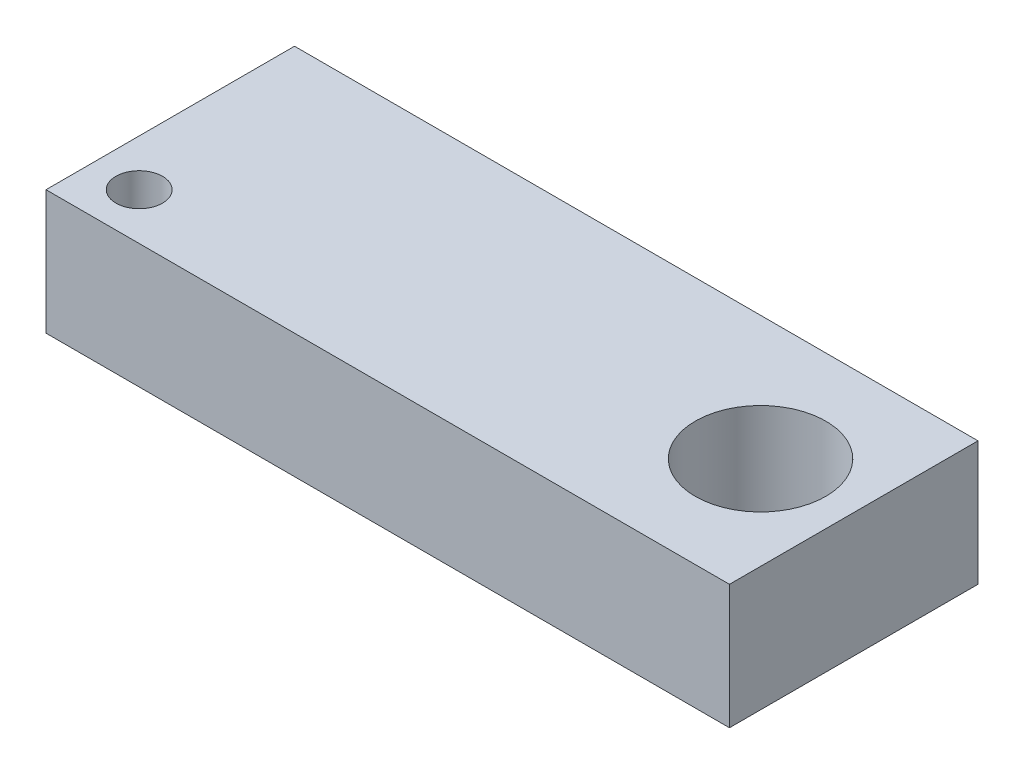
ISO-10303-21;
HEADER;
FILE_DESCRIPTION(('STEP AP214'),'2;1');
FILE_NAME('part.step','',(''),(''),'','','');
FILE_SCHEMA(('AUTOMOTIVE_DESIGN { 1 0 10303 214 1 1 1 1 }'));
ENDSEC;
DATA;
#1=APPLICATION_CONTEXT('core data for automotive mechanical design processes');
#2=APPLICATION_PROTOCOL_DEFINITION('international standard','automotive_design',2000,#1);
#3=PRODUCT_CONTEXT('',#1,'mechanical');
#4=PRODUCT('Part','Part','',(#3));
#5=PRODUCT_RELATED_PRODUCT_CATEGORY('part','',(#4));
#6=PRODUCT_DEFINITION_FORMATION('','',#4);
#7=PRODUCT_DEFINITION_CONTEXT('part definition',#1,'design');
#8=PRODUCT_DEFINITION('design','',#6,#7);
#9=PRODUCT_DEFINITION_SHAPE('','',#8);
#10=(LENGTH_UNIT() NAMED_UNIT(*) SI_UNIT(.MILLI.,.METRE.));
#11=(NAMED_UNIT(*) PLANE_ANGLE_UNIT() SI_UNIT($,.RADIAN.));
#12=(NAMED_UNIT(*) SI_UNIT($,.STERADIAN.) SOLID_ANGLE_UNIT());
#13=UNCERTAINTY_MEASURE_WITH_UNIT(LENGTH_MEASURE(1.E-05),#10,'distance_accuracy_value','');
#14=(GEOMETRIC_REPRESENTATION_CONTEXT(3) GLOBAL_UNCERTAINTY_ASSIGNED_CONTEXT((#13)) GLOBAL_UNIT_ASSIGNED_CONTEXT((#10,
#11,#12)) REPRESENTATION_CONTEXT('',''));
#15=CARTESIAN_POINT('',(0.,0.,0.));
#16=DIRECTION('',(0.,0.,1.));
#17=DIRECTION('',(1.,0.,0.));
#18=AXIS2_PLACEMENT_3D('',#15,#16,#17);
#19=CARTESIAN_POINT('',(0.,0.,80.));
#20=DIRECTION('',(1.,0.,0.));
#21=DIRECTION('',(0.,0.,-1.));
#22=AXIS2_PLACEMENT_3D('',#19,#20,#21);
#23=PLANE('',#22);
#24=DIRECTION('',(0.,-1.,0.));
#25=VECTOR('',#24,1.);
#26=CARTESIAN_POINT('',(0.,0.,0.));
#27=LINE('',#26,#25);
#28=CARTESIAN_POINT('',(0.,40.,0.));
#29=VERTEX_POINT('',#28);
#30=CARTESIAN_POINT('',(0.,0.,0.));
#31=VERTEX_POINT('',#30);
#32=EDGE_CURVE('E68',#29,#31,#27,.T.);
#33=ORIENTED_EDGE('',*,*,#32,.T.);
#34=DIRECTION('',(0.,0.,-1.));
#35=VECTOR('',#34,1.);
#36=CARTESIAN_POINT('',(0.,0.,80.));
#37=LINE('',#36,#35);
#38=CARTESIAN_POINT('',(0.,0.,80.));
#39=VERTEX_POINT('',#38);
#40=EDGE_CURVE('E11',#39,#31,#37,.T.);
#41=ORIENTED_EDGE('',*,*,#40,.F.);
#42=DIRECTION('',(0.,-1.,0.));
#43=VECTOR('',#42,1.);
#44=CARTESIAN_POINT('',(0.,0.,80.));
#45=LINE('',#44,#43);
#46=CARTESIAN_POINT('',(0.,40.,80.));
#47=VERTEX_POINT('',#46);
#48=EDGE_CURVE('E91',#47,#39,#45,.T.);
#49=ORIENTED_EDGE('',*,*,#48,.F.);
#50=DIRECTION('',(0.,0.,-1.));
#51=VECTOR('',#50,1.);
#52=CARTESIAN_POINT('',(0.,40.,80.));
#53=LINE('',#52,#51);
#54=EDGE_CURVE('E80',#47,#29,#53,.T.);
#55=ORIENTED_EDGE('',*,*,#54,.T.);
#56=EDGE_LOOP('',(#33,#41,#49,#55));
#57=FACE_BOUND('',#56,.T.);
#58=ADVANCED_FACE('F24',(#57),#23,.F.);
#59=CARTESIAN_POINT('',(0.,0.,80.));
#60=DIRECTION('',(0.,1.,0.));
#61=DIRECTION('',(0.,0.,1.));
#62=AXIS2_PLACEMENT_3D('',#59,#60,#61);
#63=PLANE('',#62);
#64=CARTESIAN_POINT('',(15.,0.,65.));
#65=DIRECTION('',(0.,1.,0.));
#66=DIRECTION('',(0.,0.,1.));
#67=AXIS2_PLACEMENT_3D('',#64,#65,#66);
#68=CIRCLE('',#67,7.5);
#69=CARTESIAN_POINT('',(15.,0.,72.5));
#70=VERTEX_POINT('',#69);
#71=EDGE_CURVE('E126',#70,#70,#68,.T.);
#72=ORIENTED_EDGE('',*,*,#71,.T.);
#73=EDGE_LOOP('',(#72));
#74=FACE_BOUND('',#73,.T.);
#75=CARTESIAN_POINT('',(190.,0.,40.));
#76=DIRECTION('',(0.,1.,0.));
#77=DIRECTION('',(0.,0.,1.));
#78=AXIS2_PLACEMENT_3D('',#75,#76,#77);
#79=CIRCLE('',#78,21.);
#80=CARTESIAN_POINT('',(190.,0.,61.));
#81=VERTEX_POINT('',#80);
#82=EDGE_CURVE('E81',#81,#81,#79,.T.);
#83=ORIENTED_EDGE('',*,*,#82,.T.);
#84=EDGE_LOOP('',(#83));
#85=FACE_BOUND('',#84,.T.);
#86=DIRECTION('',(1.,0.,0.));
#87=VECTOR('',#86,1.);
#88=CARTESIAN_POINT('',(0.,0.,0.));
#89=LINE('',#88,#87);
#90=CARTESIAN_POINT('',(220.,0.,0.));
#91=VERTEX_POINT('',#90);
#92=EDGE_CURVE('E64',#31,#91,#89,.T.);
#93=ORIENTED_EDGE('',*,*,#92,.T.);
#94=DIRECTION('',(0.,0.,-1.));
#95=VECTOR('',#94,1.);
#96=CARTESIAN_POINT('',(220.,0.,80.));
#97=LINE('',#96,#95);
#98=CARTESIAN_POINT('',(220.,0.,80.));
#99=VERTEX_POINT('',#98);
#100=EDGE_CURVE('E31',#99,#91,#97,.T.);
#101=ORIENTED_EDGE('',*,*,#100,.F.);
#102=DIRECTION('',(1.,0.,0.));
#103=VECTOR('',#102,1.);
#104=CARTESIAN_POINT('',(0.,0.,80.));
#105=LINE('',#104,#103);
#106=EDGE_CURVE('E76',#39,#99,#105,.T.);
#107=ORIENTED_EDGE('',*,*,#106,.F.);
#108=ORIENTED_EDGE('',*,*,#40,.T.);
#109=EDGE_LOOP('',(#93,#101,#107,#108));
#110=FACE_BOUND('',#109,.T.);
#111=ADVANCED_FACE('F75',(#74,#85,#110),#63,.F.);
#112=CARTESIAN_POINT('',(220.,0.,80.));
#113=DIRECTION('',(-1.,0.,0.));
#114=DIRECTION('',(0.,0.,1.));
#115=AXIS2_PLACEMENT_3D('',#112,#113,#114);
#116=PLANE('',#115);
#117=DIRECTION('',(0.,1.,0.));
#118=VECTOR('',#117,1.);
#119=CARTESIAN_POINT('',(220.,0.,0.));
#120=LINE('',#119,#118);
#121=CARTESIAN_POINT('',(220.,40.,0.));
#122=VERTEX_POINT('',#121);
#123=EDGE_CURVE('E69',#91,#122,#120,.T.);
#124=ORIENTED_EDGE('',*,*,#123,.T.);
#125=DIRECTION('',(0.,0.,-1.));
#126=VECTOR('',#125,1.);
#127=CARTESIAN_POINT('',(220.,40.,80.));
#128=LINE('',#127,#126);
#129=CARTESIAN_POINT('',(220.,40.,80.));
#130=VERTEX_POINT('',#129);
#131=EDGE_CURVE('E97',#130,#122,#128,.T.);
#132=ORIENTED_EDGE('',*,*,#131,.F.);
#133=DIRECTION('',(0.,1.,0.));
#134=VECTOR('',#133,1.);
#135=CARTESIAN_POINT('',(220.,0.,80.));
#136=LINE('',#135,#134);
#137=EDGE_CURVE('E43',#99,#130,#136,.T.);
#138=ORIENTED_EDGE('',*,*,#137,.F.);
#139=ORIENTED_EDGE('',*,*,#100,.T.);
#140=EDGE_LOOP('',(#124,#132,#138,#139));
#141=FACE_BOUND('',#140,.T.);
#142=ADVANCED_FACE('F100',(#141),#116,.F.);
#143=CARTESIAN_POINT('',(0.,40.,80.));
#144=DIRECTION('',(0.,-1.,0.));
#145=DIRECTION('',(0.,0.,-1.));
#146=AXIS2_PLACEMENT_3D('',#143,#144,#145);
#147=PLANE('',#146);
#148=CARTESIAN_POINT('',(15.,40.,65.));
#149=DIRECTION('',(0.,1.,0.));
#150=DIRECTION('',(0.,0.,1.));
#151=AXIS2_PLACEMENT_3D('',#148,#149,#150);
#152=CIRCLE('',#151,7.5);
#153=CARTESIAN_POINT('',(15.,40.,72.5));
#154=VERTEX_POINT('',#153);
#155=EDGE_CURVE('E136',#154,#154,#152,.T.);
#156=ORIENTED_EDGE('',*,*,#155,.F.);
#157=EDGE_LOOP('',(#156));
#158=FACE_BOUND('',#157,.T.);
#159=CARTESIAN_POINT('',(190.,40.,40.));
#160=DIRECTION('',(0.,1.,0.));
#161=DIRECTION('',(0.,0.,1.));
#162=AXIS2_PLACEMENT_3D('',#159,#160,#161);
#163=CIRCLE('',#162,21.);
#164=CARTESIAN_POINT('',(190.,40.,61.));
#165=VERTEX_POINT('',#164);
#166=EDGE_CURVE('E84',#165,#165,#163,.T.);
#167=ORIENTED_EDGE('',*,*,#166,.F.);
#168=EDGE_LOOP('',(#167));
#169=FACE_BOUND('',#168,.T.);
#170=DIRECTION('',(-1.,0.,0.));
#171=VECTOR('',#170,1.);
#172=CARTESIAN_POINT('',(0.,40.,0.));
#173=LINE('',#172,#171);
#174=EDGE_CURVE('E89',#122,#29,#173,.T.);
#175=ORIENTED_EDGE('',*,*,#174,.T.);
#176=ORIENTED_EDGE('',*,*,#54,.F.);
#177=DIRECTION('',(-1.,0.,0.));
#178=VECTOR('',#177,1.);
#179=CARTESIAN_POINT('',(0.,40.,80.));
#180=LINE('',#179,#178);
#181=EDGE_CURVE('E38',#130,#47,#180,.T.);
#182=ORIENTED_EDGE('',*,*,#181,.F.);
#183=ORIENTED_EDGE('',*,*,#131,.T.);
#184=EDGE_LOOP('',(#175,#176,#182,#183));
#185=FACE_BOUND('',#184,.T.);
#186=ADVANCED_FACE('F102',(#158,#169,#185),#147,.F.);
#187=CARTESIAN_POINT('',(0.,40.,80.));
#188=DIRECTION('',(0.,0.,-1.));
#189=DIRECTION('',(-1.,0.,0.));
#190=AXIS2_PLACEMENT_3D('',#187,#188,#189);
#191=PLANE('',#190);
#192=ORIENTED_EDGE('',*,*,#48,.T.);
#193=ORIENTED_EDGE('',*,*,#106,.T.);
#194=ORIENTED_EDGE('',*,*,#137,.T.);
#195=ORIENTED_EDGE('',*,*,#181,.T.);
#196=EDGE_LOOP('',(#192,#193,#194,#195));
#197=FACE_BOUND('',#196,.T.);
#198=ADVANCED_FACE('F103',(#197),#191,.F.);
#199=CARTESIAN_POINT('',(0.,40.,0.));
#200=DIRECTION('',(0.,0.,-1.));
#201=DIRECTION('',(-1.,0.,0.));
#202=AXIS2_PLACEMENT_3D('',#199,#200,#201);
#203=PLANE('',#202);
#204=ORIENTED_EDGE('',*,*,#32,.F.);
#205=ORIENTED_EDGE('',*,*,#174,.F.);
#206=ORIENTED_EDGE('',*,*,#123,.F.);
#207=ORIENTED_EDGE('',*,*,#92,.F.);
#208=EDGE_LOOP('',(#204,#205,#206,#207));
#209=FACE_BOUND('',#208,.T.);
#210=ADVANCED_FACE('F65',(#209),#203,.T.);
#211=CARTESIAN_POINT('',(190.,0.,40.));
#212=DIRECTION('',(0.,1.,0.));
#213=DIRECTION('',(0.,0.,1.));
#214=AXIS2_PLACEMENT_3D('',#211,#212,#213);
#215=CYLINDRICAL_SURFACE('',#214,21.);
#216=ORIENTED_EDGE('',*,*,#82,.F.);
#217=EDGE_LOOP('',(#216));
#218=FACE_BOUND('',#217,.T.);
#219=ORIENTED_EDGE('',*,*,#166,.T.);
#220=EDGE_LOOP('',(#219));
#221=FACE_BOUND('',#220,.T.);
#222=ADVANCED_FACE('F110',(#218,#221),#215,.F.);
#223=CARTESIAN_POINT('',(15.,0.,65.));
#224=DIRECTION('',(0.,1.,0.));
#225=DIRECTION('',(0.,0.,1.));
#226=AXIS2_PLACEMENT_3D('',#223,#224,#225);
#227=CYLINDRICAL_SURFACE('',#226,7.5);
#228=ORIENTED_EDGE('',*,*,#71,.F.);
#229=EDGE_LOOP('',(#228));
#230=FACE_BOUND('',#229,.T.);
#231=ORIENTED_EDGE('',*,*,#155,.T.);
#232=EDGE_LOOP('',(#231));
#233=FACE_BOUND('',#232,.T.);
#234=ADVANCED_FACE('F131',(#230,#233),#227,.F.);
#235=CLOSED_SHELL('',(#58,#111,#142,#186,#198,#210,#222,#234));
#236=MANIFOLD_SOLID_BREP('B2',#235);
#237=ADVANCED_BREP_SHAPE_REPRESENTATION('',(#18,#236),#14);
#238=SHAPE_DEFINITION_REPRESENTATION(#9,#237);
ENDSEC;
END-ISO-10303-21;
